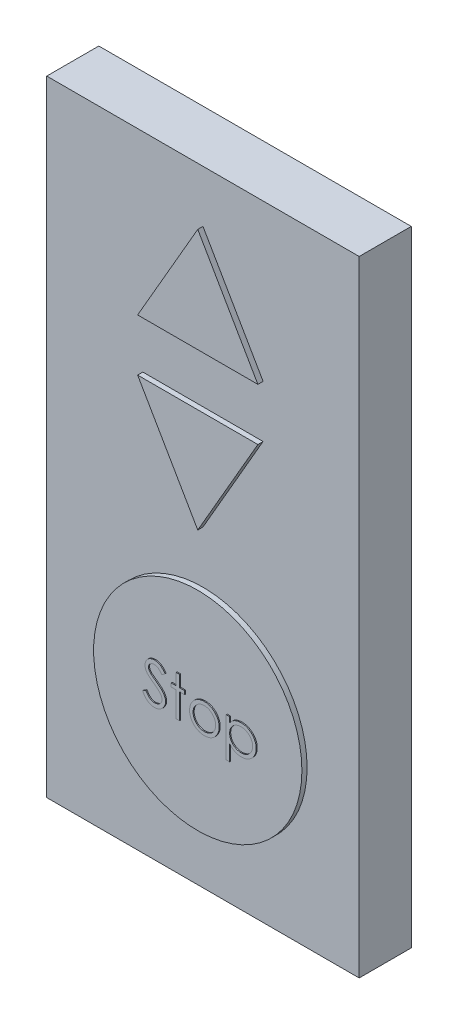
from build123d import *

# Parameters (mm, degrees)
SKETCH1_W           = 76.2
SKETCH1_H           = 152.4
BOSS_EXTRUDE1_DEPTH = 12.7
BOSS_EXTRUDE2_DEPTH = 1.27
SKETCH3_R           = 25.4
BOSS_EXTRUDE3_DEPTH = 1.27
BOSS_EXTRUDE4_DEPTH = 0.254


with BuildPart() as part:
    # Sketch1 → Boss-Extrude1 (new body)
    with BuildSketch(Plane.XY):
        with Locations((-3.777571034, -47.015409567)):
            Rectangle(SKETCH1_W, SKETCH1_H)
    extrude(amount=BOSS_EXTRUDE1_DEPTH)

    # Sketch2 → Boss-Extrude2 (add)
    with BuildSketch(Plane.XY.offset(12.7)):
        Polygon((-18.442267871, -8.915409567), (10.887125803, -8.915409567), (-3.777571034, 16.484590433), align=None)
        Polygon((-18.442267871, -21.615409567), (10.887125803, -21.615409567), (-3.777571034, -47.015409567), align=None)
    extrude(amount=BOSS_EXTRUDE2_DEPTH)

    # Sketch3 → Boss-Extrude3 (add)
    with BuildSketch(Plane.XY.offset(12.7)):
        with Locations((-3.777571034, -85.115409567)):
            Circle(SKETCH3_R)
    extrude(amount=BOSS_EXTRUDE3_DEPTH)

    # Sketch4 → Boss-Extrude4 (add)
    # profile 1 of 4: a face of its own
    with BuildSketch(Plane.XY.offset(13.97)):
        with BuildLine():
            Line((-16.991854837, -87.422543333), (-16.18665652, -86.939805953))
            add(Edge.make_bspline(
                [(-16.18665652, -86.939805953), (-16.111767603, -87.065166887), (-15.968283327, -87.305353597), (-15.728929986, -87.629905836), (-15.480918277, -87.905755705), (-15.222411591, -88.131298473), (-14.954987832, -88.308868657), (-14.676901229, -88.434604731), (-14.389088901, -88.51302535), (-14.193217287, -88.522550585), (-14.095430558, -88.527305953)],
                knots=[0, 0, 0, 0, 1.272034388, 2.437168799, 3.508375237, 4.49857839, 5.41946034, 6.295179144, 7.148887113, 8, 8, 8, 8], degree=3))
            add(Edge.make_bspline(
                [(-14.095430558, -88.527305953), (-14.011918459, -88.524980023), (-13.846355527, -88.520368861), (-13.60261828, -88.476061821), (-13.365903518, -88.407993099), (-13.141090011, -88.310508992), (-12.931279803, -88.192566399), (-12.747293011, -88.050110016), (-12.588236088, -87.890617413), (-12.458126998, -87.712683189), (-12.358304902, -87.521320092), (-12.281582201, -87.324898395), (-12.239005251, -87.120332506), (-12.232591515, -86.982599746), (-12.229354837, -86.913093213)],
                knots=[0, 0, 0, 0, 1.095163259, 2.171163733, 3.241058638, 4.321873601, 5.38011039, 6.391990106, 7.366004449, 8.327778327, 9.272591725, 10.192022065, 11.087607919, 12, 12, 12, 12], degree=3))
            add(Edge.make_bspline(
                [(-12.229354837, -86.913093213), (-12.233367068, -86.833788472), (-12.241523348, -86.672573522), (-12.310461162, -86.434721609), (-12.418908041, -86.199338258), (-12.51895495, -86.053738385), (-12.570896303, -85.978147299)],
                knots=[0, 0, 0, 0, 0.938893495, 1.908633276, 2.914225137, 4, 4, 4, 4], degree=3))
            add(Edge.make_bspline(
                [(-12.570896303, -85.978147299), (-12.61354276, -85.923591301), (-12.703073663, -85.809057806), (-12.856990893, -85.638573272), (-13.037601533, -85.462718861), (-13.238724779, -85.27477957), (-13.467686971, -85.083496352), (-13.717316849, -84.879747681), (-13.99398778, -84.671281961), (-14.188024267, -84.531475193), (-14.288143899, -84.459337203)],
                knots=[0, 0, 0, 0, 0.722233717, 1.516239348, 2.393582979, 3.351407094, 4.387010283, 5.505090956, 6.712668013, 8, 8, 8, 8], degree=3))
            add(Edge.make_bspline(
                [(-14.288143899, -84.459337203), (-14.388357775, -84.387957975), (-14.579959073, -84.251486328), (-14.847907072, -84.048945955), (-15.087513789, -83.863769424), (-15.297714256, -83.694213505), (-15.478416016, -83.540255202), (-15.631043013, -83.403372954), (-15.751707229, -83.279864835), (-15.818805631, -83.199742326), (-15.848931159, -83.163769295)],
                knots=[0, 0, 0, 0, 1.452282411, 2.77665338, 3.964542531, 5.026858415, 5.96415736, 6.766646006, 7.446254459, 8, 8, 8, 8], degree=3))
            add(Edge.make_bspline(
                [(-15.848931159, -83.163769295), (-15.891038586, -83.107705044), (-15.973848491, -82.997447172), (-16.083157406, -82.825113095), (-16.176064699, -82.648701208), (-16.248896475, -82.467737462), (-16.310227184, -82.284762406), (-16.35147841, -82.097388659), (-16.377308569, -81.90645699), (-16.379953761, -81.77796882), (-16.381277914, -81.713649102)],
                knots=[0, 0, 0, 0, 1.068054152, 2.10047183, 3.106115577, 4.101338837, 5.06977816, 6.043150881, 7.020423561, 8, 8, 8, 8], degree=3))
            add(Edge.make_bspline(
                [(-16.381277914, -81.713649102), (-16.377725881, -81.612875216), (-16.370697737, -81.413481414), (-16.311260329, -81.122204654), (-16.217444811, -80.844111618), (-16.086013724, -80.581955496), (-15.916584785, -80.342562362), (-15.720516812, -80.123178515), (-15.486986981, -79.93875116), (-15.230757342, -79.777609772), (-14.950296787, -79.651482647), (-14.656407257, -79.556338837), (-14.348621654, -79.502429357), (-14.140151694, -79.494692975), (-14.034372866, -79.490767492)],
                knots=[0, 0, 0, 0, 1.005424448, 1.989358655, 2.955360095, 3.929531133, 4.905563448, 5.876582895, 6.856512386, 7.866279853, 8.892233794, 9.918561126, 10.94386622, 12, 12, 12, 12], degree=3))
            add(Edge.make_bspline(
                [(-14.034372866, -79.490767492), (-13.922129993, -79.494638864), (-13.698914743, -79.502337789), (-13.37057652, -79.569278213), (-13.054453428, -79.680042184), (-12.800154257, -79.805741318), (-12.601128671, -79.931284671), (-12.449347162, -80.045638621), (-12.295538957, -80.177288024), (-12.138463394, -80.326583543), (-11.980782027, -80.494895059), (-11.820153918, -80.681069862), (-11.656203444, -80.883970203), (-11.550732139, -81.028816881), (-11.496662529, -81.103072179)],
                knots=[0, 0, 0, 0, 1.286793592, 2.559021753, 3.825965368, 5.121522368, 5.803751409, 6.523245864, 7.299691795, 8.125521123, 9.008227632, 9.944561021, 10.946284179, 12, 12, 12, 12], degree=3))
            Line((-11.496662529, -81.103072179), (-12.269423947, -81.688844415))
            add(Edge.make_bspline(
                [(-12.269423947, -81.688844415), (-12.316085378, -81.628731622), (-12.405944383, -81.512968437), (-12.542368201, -81.350849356), (-12.670952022, -81.202758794), (-12.79763561, -81.074130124), (-12.915728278, -80.957919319), (-13.0303468, -80.858424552), (-13.139841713, -80.774670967), (-13.277864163, -80.685289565), (-13.451267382, -80.596689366), (-13.668939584, -80.521716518), (-13.896413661, -80.476663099), (-14.051343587, -80.470706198), (-14.12977551, -80.467690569)],
                knots=[0, 0, 0, 0, 1.181633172, 2.275549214, 3.290209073, 4.226197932, 5.078386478, 5.862611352, 6.581680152, 7.217281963, 8.414376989, 9.595101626, 10.782541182, 12, 12, 12, 12], degree=3))
            add(Edge.make_bspline(
                [(-14.12977551, -80.467690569), (-14.228172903, -80.470988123), (-14.417923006, -80.477347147), (-14.687317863, -80.546797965), (-14.929780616, -80.656150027), (-15.138112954, -80.809407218), (-15.311568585, -80.990983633), (-15.437041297, -81.199931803), (-15.512561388, -81.430661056), (-15.521776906, -81.591610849), (-15.526470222, -81.673579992)],
                knots=[0, 0, 0, 0, 1.14458467, 2.207223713, 3.21896685, 4.227309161, 5.202851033, 6.127160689, 7.046193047, 8, 8, 8, 8], degree=3))
            add(Edge.make_bspline(
                [(-15.526470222, -81.673579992), (-15.525400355, -81.724610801), (-15.523258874, -81.826755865), (-15.493391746, -81.977662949), (-15.455021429, -82.128188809), (-15.394217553, -82.277656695), (-15.310274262, -82.428680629), (-15.200042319, -82.583861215), (-15.061213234, -82.744566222), (-14.954867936, -82.849089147), (-14.898720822, -82.904274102)],
                knots=[0, 0, 0, 0, 0.858281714, 1.717966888, 2.583508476, 3.4729293, 4.427298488, 5.488583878, 6.674047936, 8, 8, 8, 8], degree=3))
            add(Edge.make_bspline(
                [(-14.898720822, -82.904274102), (-14.877870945, -82.92288058), (-14.828336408, -82.967085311), (-14.737778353, -83.039454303), (-14.618191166, -83.128724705), (-14.472697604, -83.239180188), (-14.298614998, -83.367309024), (-14.095924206, -83.511472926), (-13.866884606, -83.676351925), (-13.704355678, -83.791624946), (-13.618417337, -83.852576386)],
                knots=[0, 0, 0, 0, 0.420754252, 0.999615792, 1.744751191, 2.668019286, 3.750313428, 4.999500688, 6.413464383, 8, 8, 8, 8], degree=3))
            add(Edge.make_bspline(
                [(-13.618417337, -83.852576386), (-13.515041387, -83.927800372), (-13.314868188, -84.073461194), (-13.03005006, -84.292306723), (-12.771803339, -84.506341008), (-12.539221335, -84.71419721), (-12.33000632, -84.914298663), (-12.14647938, -85.109052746), (-11.986770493, -85.297064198), (-11.814832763, -85.538108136), (-11.639143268, -85.834148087), (-11.488263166, -86.196855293), (-11.39312652, -86.560972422), (-11.380685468, -86.805701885), (-11.374547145, -86.926449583)],
                knots=[0, 0, 0, 0, 1.163667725, 2.253281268, 3.268753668, 4.215851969, 5.092017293, 5.902905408, 6.650798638, 7.335211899, 8.59617414, 9.77448103, 10.901945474, 12, 12, 12, 12], degree=3))
            add(Edge.make_bspline(
                [(-11.374547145, -86.926449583), (-11.376335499, -87.011843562), (-11.379877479, -87.180973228), (-11.420592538, -87.429317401), (-11.480245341, -87.670519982), (-11.570153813, -87.90159951), (-11.679890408, -88.126783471), (-11.819135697, -88.340164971), (-11.980537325, -88.54646667), (-12.165686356, -88.740187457), (-12.368285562, -88.918022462), (-12.582417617, -89.076216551), (-12.808433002, -89.208119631), (-13.045105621, -89.315754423), (-13.292489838, -89.399937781), (-13.550502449, -89.460932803), (-13.819568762, -89.498367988), (-14.002450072, -89.502253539), (-14.095430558, -89.50422903)],
                knots=[0, 0, 0, 0, 0.983748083, 1.948392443, 2.894712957, 3.844097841, 4.80183111, 5.778335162, 6.776009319, 7.81870978, 8.863265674, 9.881300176, 10.883814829, 11.87499822, 12.874611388, 13.892143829, 14.928324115, 16, 16, 16, 16], degree=3))
            add(Edge.make_bspline(
                [(-14.095430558, -89.50422903), (-14.167372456, -89.502837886), (-14.310350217, -89.500073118), (-14.521831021, -89.475631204), (-14.729039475, -89.44104973), (-14.929375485, -89.386147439), (-15.125420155, -89.319535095), (-15.316320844, -89.237515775), (-15.502170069, -89.139225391), (-15.684009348, -89.026843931), (-15.861376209, -88.896058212), (-16.032607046, -88.74373034), (-16.203320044, -88.574061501), (-16.368476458, -88.382444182), (-16.531416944, -88.171974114), (-16.688928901, -87.940682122), (-16.844272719, -87.689828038), (-16.941741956, -87.51330234), (-16.991854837, -87.422543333)],
                knots=[0, 0, 0, 0, 0.915332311, 1.819136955, 2.706846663, 3.586547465, 4.459518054, 5.340707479, 6.227863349, 7.133153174, 8.059268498, 9.028702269, 10.047606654, 11.120612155, 12.245963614, 13.433783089, 14.680604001, 16, 16, 16, 16], degree=3))
        make_face()
    # profile 2 of 4: a face of its own
    with BuildSketch(Plane.XY.offset(13.97)):
        Polygon((-8.810124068, -79.490767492), (-7.955316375, -79.490767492), (-7.955316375, -82.299421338), (-6.734162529, -82.299421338), (-6.734162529, -83.15422903), (-7.955316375, -83.15422903), (-7.955316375, -89.259998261), (-8.810124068, -89.259998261), (-8.810124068, -83.15422903), (-10.031277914, -83.15422903), (-10.031277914, -82.299421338), (-8.810124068, -82.299421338), align=None)
    # profile 3 of 4: a face of its own
    with BuildSketch(Plane.XY.offset(13.97)):
        with BuildLine():
            add(Edge.make_bspline(
                [(-1.906788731, -82.177305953), (-1.77618391, -82.180086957), (-1.520099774, -82.185539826), (-1.145065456, -82.243819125), (-0.787074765, -82.332938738), (-0.444756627, -82.456142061), (-0.122495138, -82.621283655), (0.184403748, -82.818340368), (0.475098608, -83.051791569), (0.649332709, -83.232380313), (0.737772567, -83.324045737)],
                knots=[0, 0, 0, 0, 1.054011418, 2.066658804, 3.057071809, 4.030435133, 4.997543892, 5.974964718, 6.972108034, 8, 8, 8, 8], degree=3))
            add(Edge.make_bspline(
                [(0.737772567, -83.324045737), (0.813923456, -83.411713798), (0.964751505, -83.585353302), (1.158151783, -83.866900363), (1.324761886, -84.158474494), (1.45828323, -84.463947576), (1.563561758, -84.780652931), (1.638307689, -85.109679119), (1.68276749, -85.450299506), (1.688762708, -85.68163138), (1.691799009, -85.798790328)],
                knots=[0, 0, 0, 0, 1.025258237, 2.030674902, 3.01204498, 3.988269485, 4.97094183, 5.956517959, 6.965070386, 8, 8, 8, 8], degree=3))
            add(Edge.make_bspline(
                [(1.691799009, -85.798790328), (1.68912837, -85.916628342), (1.683851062, -86.149481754), (1.63393022, -86.492434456), (1.556284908, -86.824978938), (1.445163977, -87.145722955), (1.302675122, -87.455646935), (1.12880118, -87.753397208), (0.922321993, -88.039561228), (0.688268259, -88.311709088), (0.429591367, -88.562532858), (0.148968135, -88.781140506), (-0.148086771, -88.968433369), (-0.465523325, -89.119299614), (-0.8004427, -89.238252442), (-1.153567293, -89.321800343), (-1.52434852, -89.37231464), (-1.777515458, -89.378801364), (-1.906788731, -89.382113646)],
                knots=[0, 0, 0, 0, 0.998656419, 1.973391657, 2.932242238, 3.890759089, 4.846373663, 5.82037756, 6.809684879, 7.83454468, 8.860553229, 9.859544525, 10.845671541, 11.83227036, 12.833544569, 13.85385346, 14.904124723, 16, 16, 16, 16], degree=3))
            add(Edge.make_bspline(
                [(-1.906788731, -89.382113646), (-2.036695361, -89.378790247), (-2.291124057, -89.372281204), (-2.663214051, -89.321996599), (-3.016971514, -89.238290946), (-3.352329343, -89.118908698), (-3.671130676, -88.968428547), (-3.969906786, -88.781706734), (-4.250757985, -88.562468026), (-4.509489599, -88.311726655), (-4.743528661, -88.039556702), (-4.950011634, -87.753398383), (-5.123884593, -87.455646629), (-5.266373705, -87.145723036), (-5.377494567, -86.824978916), (-5.455139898, -86.492434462), (-5.505060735, -86.149481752), (-5.510338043, -85.916628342), (-5.513008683, -85.798790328)],
                knots=[0, 0, 0, 0, 1.099876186, 2.154163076, 3.173186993, 4.173200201, 5.163417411, 6.152872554, 7.150605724, 8.17532212, 9.198891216, 10.186952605, 11.159729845, 12.11414092, 13.071450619, 14.029093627, 15.002601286, 16, 16, 16, 16], degree=3))
            add(Edge.make_bspline(
                [(-5.513008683, -85.798790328), (-5.509951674, -85.682268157), (-5.503899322, -85.451574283), (-5.459484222, -85.111594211), (-5.385029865, -84.783124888), (-5.279625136, -84.467641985), (-5.144873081, -84.163507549), (-4.980604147, -83.871212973), (-4.785231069, -83.59093903), (-4.635002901, -83.417523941), (-4.558982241, -83.329769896)],
                knots=[0, 0, 0, 0, 1.031353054, 2.041901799, 3.029428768, 4.008703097, 4.981709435, 5.96992636, 6.972712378, 8, 8, 8, 8], degree=3))
            add(Edge.make_bspline(
                [(-4.558982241, -83.329769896), (-4.470675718, -83.237309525), (-4.297005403, -83.055469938), (-4.004863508, -82.822699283), (-3.698719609, -82.621541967), (-3.372896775, -82.459681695), (-3.030859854, -82.332214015), (-2.67103463, -82.243589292), (-2.294727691, -82.185749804), (-2.037390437, -82.18014862), (-1.906788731, -82.177305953)],
                knots=[0, 0, 0, 0, 1.027980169, 2.021703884, 2.998553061, 3.971491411, 4.943284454, 5.930300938, 6.949603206, 8, 8, 8, 8], degree=3))
        make_face()
        with BuildLine():
            add(Edge.make_bspline(
                [(-1.910604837, -83.032113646), (-2.002963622, -83.034738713), (-2.185296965, -83.039921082), (-2.453683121, -83.079337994), (-2.712055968, -83.141787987), (-2.960905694, -83.230517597), (-3.199393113, -83.345086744), (-3.427746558, -83.485807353), (-3.646637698, -83.650815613), (-3.851784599, -83.839853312), (-4.04005932, -84.046352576), (-4.204645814, -84.266375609), (-4.344595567, -84.496353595), (-4.461182, -84.736525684), (-4.548015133, -84.989325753), (-4.611078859, -85.251890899), (-4.650458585, -85.524756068), (-4.655592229, -85.710251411), (-4.658200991, -85.804514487)],
                knots=[0, 0, 0, 0, 1.021534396, 2.016698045, 2.994645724, 3.958388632, 4.93408049, 5.916473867, 6.921342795, 7.962252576, 8.998418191, 10.008913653, 10.997312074, 11.973003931, 12.956656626, 13.948281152, 14.957379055, 16, 16, 16, 16], degree=3))
            add(Edge.make_bspline(
                [(-4.658200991, -85.804514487), (-4.653828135, -85.926303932), (-4.645148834, -86.168033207), (-4.574567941, -86.524026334), (-4.456495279, -86.865788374), (-4.297054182, -87.191315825), (-4.097284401, -87.492502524), (-3.861916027, -87.761029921), (-3.593475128, -87.992857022), (-3.295161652, -88.185209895), (-2.97306883, -88.338044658), (-2.632192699, -88.446354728), (-2.276663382, -88.516762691), (-2.033692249, -88.523760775), (-1.910604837, -88.527305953)],
                knots=[0, 0, 0, 0, 1.016792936, 2.018143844, 3.017858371, 4.030088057, 5.03801393, 6.028138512, 7.003788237, 7.991172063, 8.984598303, 9.972568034, 10.972917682, 12, 12, 12, 12], degree=3))
            add(Edge.make_bspline(
                [(-1.910604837, -88.527305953), (-1.787524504, -88.523740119), (-1.544567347, -88.516701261), (-1.189532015, -88.446709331), (-0.849587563, -88.337570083), (-0.527829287, -88.185381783), (-0.229651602, -87.992126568), (0.040719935, -87.762338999), (0.274078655, -87.491791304), (0.473650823, -87.190916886), (0.63570303, -86.866293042), (0.753223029, -86.523963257), (0.823973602, -86.168049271), (0.83263, -85.926309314), (0.836991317, -85.804514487)],
                knots=[0, 0, 0, 0, 1.02726834, 2.027799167, 3.010890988, 4.004497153, 4.992059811, 5.971914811, 6.958719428, 7.966827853, 8.981595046, 9.981490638, 10.983022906, 12, 12, 12, 12], degree=3))
            add(Edge.make_bspline(
                [(0.836991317, -85.804514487), (0.834383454, -85.710250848), (0.829251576, -85.524754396), (0.789858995, -85.251897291), (0.726842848, -84.989302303), (0.639834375, -84.736612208), (0.523754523, -84.49573175), (0.381105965, -84.26705085), (0.217191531, -84.045590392), (0.026644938, -83.840520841), (-0.178287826, -83.65074192), (-0.39726768, -83.485743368), (-0.625282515, -83.345705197), (-0.863077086, -83.229537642), (-1.111958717, -83.142595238), (-1.369969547, -83.078977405), (-1.637210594, -83.040087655), (-1.818890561, -83.034788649), (-1.910604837, -83.032113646)],
                knots=[0, 0, 0, 0, 1.042956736, 2.052379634, 3.044323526, 4.02829302, 5.004299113, 5.996692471, 7.007513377, 8.048758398, 9.090003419, 10.095195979, 11.07790575, 12.047570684, 13.018257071, 13.989683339, 14.985167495, 16, 16, 16, 16], degree=3))
        make_face(mode=Mode.SUBTRACT)
    # profile 4 of 4: a face of its own
    with BuildSketch(Plane.XY.offset(13.97)):
        with BuildLine():
            Line((3.401414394, -82.299421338), (4.256222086, -82.299421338))
            Line((4.256222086, -82.299421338), (4.256222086, -83.587357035))
            add(Edge.make_bspline(
                [(4.256222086, -83.587357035), (4.347002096, -83.470505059), (4.523414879, -83.243426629), (4.827466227, -82.949539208), (5.148395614, -82.701684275), (5.494461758, -82.50742181), (5.860286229, -82.360952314), (6.24436775, -82.252695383), (6.649966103, -82.188901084), (6.927270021, -82.181222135), (7.068692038, -82.177305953)],
                knots=[0, 0, 0, 0, 1.0828784, 2.104357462, 3.088488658, 4.04616522, 5.001424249, 5.969181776, 6.964304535, 8, 8, 8, 8], degree=3))
            add(Edge.make_bspline(
                [(7.068692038, -82.177305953), (7.192222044, -82.180879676), (7.43638559, -82.187943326), (7.795786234, -82.235767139), (8.141884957, -82.317730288), (8.472723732, -82.435842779), (8.791846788, -82.581862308), (9.094529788, -82.766149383), (9.385487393, -82.979526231), (9.657402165, -83.225086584), (9.908648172, -83.490774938), (10.125943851, -83.776585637), (10.313373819, -84.073119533), (10.464876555, -84.384973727), (10.583553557, -84.709692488), (10.667957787, -85.048587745), (10.718188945, -85.400402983), (10.724928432, -85.639623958), (10.728337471, -85.760629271)],
                knots=[0, 0, 0, 0, 1.041296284, 2.058176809, 3.050446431, 4.034000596, 5.01514041, 6.003636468, 7.015969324, 8.052561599, 9.08815499, 10.094063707, 11.074456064, 12.040834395, 13.011057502, 13.983766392, 14.980127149, 16, 16, 16, 16], degree=3))
            add(Edge.make_bspline(
                [(10.728337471, -85.760629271), (10.725002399, -85.88418841), (10.718425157, -86.127864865), (10.667411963, -86.485697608), (10.585886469, -86.829923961), (10.4687067, -87.159971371), (10.317282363, -87.475612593), (10.133029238, -87.77662), (9.915623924, -88.062897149), (9.667154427, -88.330557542), (9.397588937, -88.5771171), (9.109450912, -88.792757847), (8.807211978, -88.973845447), (8.492418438, -89.125110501), (8.16237545, -89.239117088), (7.818622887, -89.321352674), (7.461347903, -89.372065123), (7.218321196, -89.378738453), (7.095404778, -89.382113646)],
                knots=[0, 0, 0, 0, 1.038740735, 2.04854663, 3.033179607, 4.009277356, 4.987731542, 5.972001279, 6.972200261, 8.005528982, 9.039189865, 10.040446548, 11.026516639, 11.997840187, 12.972163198, 13.956796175, 14.96660207, 16, 16, 16, 16], degree=3))
            add(Edge.make_bspline(
                [(7.095404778, -89.382113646), (6.957081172, -89.378589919), (6.683851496, -89.371629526), (6.284352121, -89.301091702), (5.89987726, -89.195671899), (5.534686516, -89.041369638), (5.185886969, -88.844731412), (4.85545164, -88.60494578), (4.541625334, -88.322514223), (4.352734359, -88.108251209), (4.256222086, -87.998775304)],
                knots=[0, 0, 0, 0, 1.014726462, 2.004382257, 2.969841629, 3.936926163, 4.907207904, 5.903978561, 6.929055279, 8, 8, 8, 8], degree=3))
            Line((4.256222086, -87.998775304), (4.256222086, -91.824421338))
            Line((4.256222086, -91.824421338), (3.401414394, -91.824421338))
            Line((3.401414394, -91.824421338), (3.401414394, -82.299421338))
        make_face()
        with BuildLine():
            add(Edge.make_bspline(
                [(7.061059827, -83.032113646), (6.964232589, -83.033856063), (6.773604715, -83.037286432), (6.494189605, -83.078036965), (6.225052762, -83.137194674), (5.968906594, -83.22676206), (5.723295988, -83.336704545), (5.490112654, -83.474087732), (5.269520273, -83.636426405), (5.062073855, -83.820610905), (4.874667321, -84.023560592), (4.708761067, -84.24015313), (4.569404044, -84.470114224), (4.453737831, -84.711301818), (4.365717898, -84.965606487), (4.303245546, -85.2315799), (4.263974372, -85.509513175), (4.258833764, -85.698804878), (4.256222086, -85.794974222)],
                knots=[0, 0, 0, 0, 1.05670511, 2.080379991, 3.077984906, 4.06214886, 5.038337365, 6.01289324, 7.01187578, 8.025460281, 9.038092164, 10.024533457, 11.000252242, 11.969694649, 12.940728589, 13.933144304, 14.949937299, 16, 16, 16, 16], degree=3))
            add(Edge.make_bspline(
                [(4.256222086, -85.794974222), (4.260551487, -85.921216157), (4.269033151, -86.168534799), (4.337986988, -86.529897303), (4.450205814, -86.871849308), (4.609487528, -87.19151113), (4.810730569, -87.485378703), (5.053204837, -87.748515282), (5.334716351, -87.979266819), (5.650584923, -88.173634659), (5.989190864, -88.33144504), (6.342393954, -88.444422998), (6.705336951, -88.514015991), (6.950723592, -88.522851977), (7.074416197, -88.527305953)],
                knots=[0, 0, 0, 0, 1.03728447, 2.032128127, 3.01272805, 3.987917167, 4.958271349, 5.931593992, 6.91984656, 7.941419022, 8.973179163, 9.983609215, 10.983593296, 12, 12, 12, 12], degree=3))
            add(Edge.make_bspline(
                [(7.074416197, -88.527305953), (7.195617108, -88.523070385), (7.436179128, -88.514663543), (7.790395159, -88.441897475), (8.134630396, -88.330740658), (8.461692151, -88.16865358), (8.768733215, -87.97001635), (9.045996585, -87.731727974), (9.288222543, -87.455530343), (9.494681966, -87.147985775), (9.661046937, -86.818215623), (9.786042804, -86.47699913), (9.858183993, -86.125539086), (9.868407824, -85.888781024), (9.873529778, -85.770169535)],
                knots=[0, 0, 0, 0, 1.00104056, 1.986885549, 2.97790532, 3.984399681, 4.995088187, 5.994304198, 6.996462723, 8.023150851, 9.048424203, 10.043036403, 11.019596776, 12, 12, 12, 12], degree=3))
            add(Edge.make_bspline(
                [(9.873529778, -85.770169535), (9.869570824, -85.650821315), (9.86168376, -85.413054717), (9.783995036, -85.062635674), (9.667245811, -84.720040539), (9.49699582, -84.3947739), (9.295062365, -84.087867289), (9.050822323, -83.816938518), (8.777002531, -83.579709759), (8.470327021, -83.383724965), (8.141196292, -83.227826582), (7.794717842, -83.113843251), (7.432649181, -83.04533469), (7.186012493, -83.036559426), (7.061059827, -83.032113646)],
                knots=[0, 0, 0, 0, 0.983928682, 1.960191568, 2.949917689, 3.96440592, 4.982380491, 5.975291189, 6.965713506, 7.964880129, 8.970154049, 9.96478489, 10.968906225, 12, 12, 12, 12], degree=3))
        make_face(mode=Mode.SUBTRACT)
    extrude(amount=BOSS_EXTRUDE4_DEPTH)


solid = part.part
